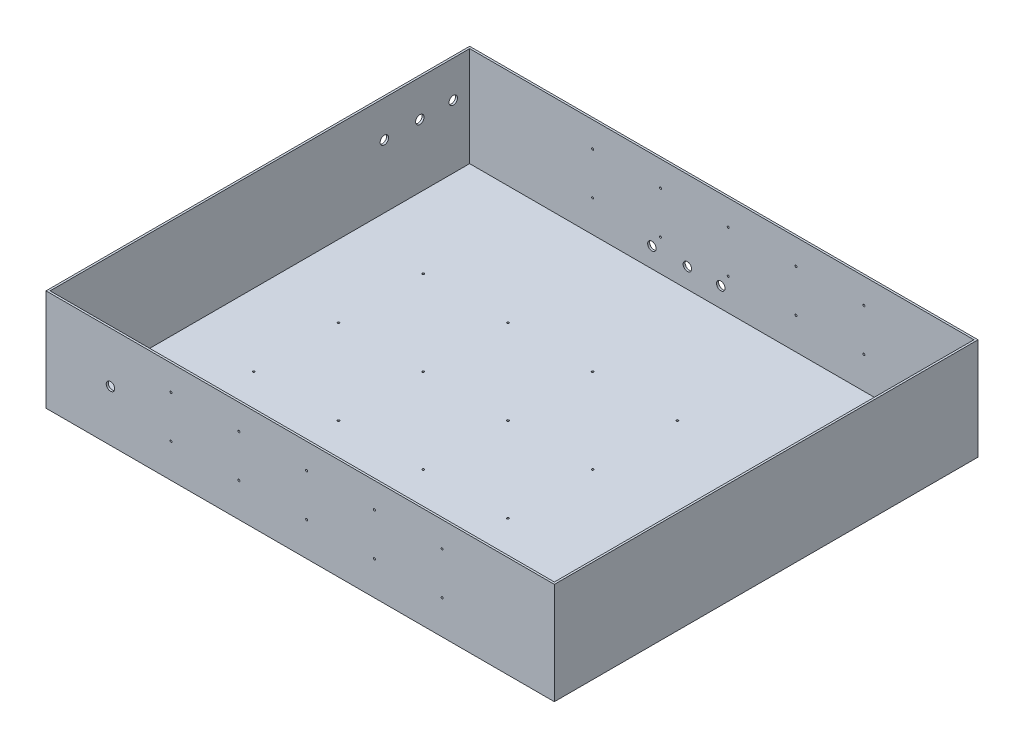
from build123d import *

# Parameters (mm, degrees)
SKETCH1_W                              = 762
SKETCH1_H                              = 635
EXTRUDE1_DEPTH                         = 152.4
SHELL1_T                               = -3.048
SKETCH2_R                              = 6.35
CONNECTOR_MOUNT_CUT_EXTRUDE1_DEPTH     = 824.143737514
SKETCH3_R                              = 1.524
CLIP_MOUNT_CUT_EXTRUDE2_DEPTH          = 828.354071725
LPATTERN2_COUNT                        = 5
LPATTERN2_PITCH                        = 101.6
LPATTERN2_COUNT_DIR2                   = 2
LPATTERN2_PITCH_DIR2                   = 63.5
SKETCH4_R                              = 6.35
LOWER_CONNECTOR_MNT_CUT_EXTRUDE1_DEPTH = 3.048
SKETCH5_R                              = 1.524
CUT_EXTRUDE1_DEPTH                     = 3.048
LPATTERN4_COUNT                        = 3
LPATTERN4_PITCH                        = 127
LPATTERN4_COUNT_DIR2                   = 5
LPATTERN4_PITCH_DIR2                   = 127
SKETCH6_R                              = 6.35
CUT_EXTRUDE2_DEPTH                     = 928.579622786


with BuildPart() as part:
    # Sketch1 → Extrude1 (new body)
    with BuildSketch(Plane(origin=(0, 0, 0), x_dir=(1, 0, 0), z_dir=(0, 1, 0))):
        with Locations((-127, 190.5)):
            Rectangle(SKETCH1_W, SKETCH1_H)
    extrude(amount=EXTRUDE1_DEPTH)

    # Shell1
    shell1_openings = [part.faces().sort_by_distance(p)[0] for p in [
        (-127, 152.4, -190.5),
    ]]
    offset(amount=SHELL1_T, openings=shell1_openings, kind=Kind.INTERSECTION)

    # Sketch2 → Connector mount--Cut-Extrude1 (cut, through all)
    with BuildSketch(Plane(origin=(-3.048, 0, -504.952), x_dir=(1, 0, 0), z_dir=(0, 0, 1))):
        with Locations((-228.718392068, 32.6517)):
            Circle(SKETCH2_R)
        with Locations((-175.538392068, 32.6517)):
            Circle(SKETCH2_R)
        with Locations((-125.411535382, 32.6517)):
            Circle(SKETCH2_R)
    extrude(amount=-CONNECTOR_MOUNT_CUT_EXTRUDE1_DEPTH, mode=Mode.SUBTRACT)

    # Sketch3 → Clip Mount --Cut-Extrude2 (cut, through all)
    with BuildSketch(Plane(origin=(0, 0, -508), x_dir=(-1, 0, 0), z_dir=(0, 0, -1))):
        with Locations((-85.852, 114.3)):
            Circle(SKETCH3_R)
    clip_mount_cut_extrude2 = extrude(amount=-CLIP_MOUNT_CUT_EXTRUDE2_DEPTH, mode=Mode.SUBTRACT)

    # LPattern2: Clip Mount --Cut-Extrude2 5 × 2
    with Locations(*[(-i * LPATTERN2_PITCH, -j * LPATTERN2_PITCH_DIR2, 0) for i in range(LPATTERN2_COUNT) for j in range(LPATTERN2_COUNT_DIR2) if (i, j) != (0, 0)]):
        add(clip_mount_cut_extrude2, mode=Mode.SUBTRACT)

    # Sketch4 → Lower Connector Mnt--Cut-Extrude1 (cut)
    with BuildSketch(Plane.XY.offset(127)):
        with Locations((-411.374764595, 76.774011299)):
            Circle(SKETCH4_R)
    extrude(amount=-LOWER_CONNECTOR_MNT_CUT_EXTRUDE1_DEPTH, mode=Mode.SUBTRACT)

    # Sketch5 → Cut-Extrude1 (cut)
    with BuildSketch(Plane(origin=(0, 3.048, 0), x_dir=(-1, 0, 0), z_dir=(0, 1, 0))):
        with Locations(Location((-111.252, -327.152, 0), (0, 0, 90))):
            Circle(SKETCH5_R)
    cut_extrude1 = extrude(amount=-CUT_EXTRUDE1_DEPTH, mode=Mode.SUBTRACT)

    # LPattern4: Cut-Extrude1 3 × 5
    with Locations(*[(-j * LPATTERN4_PITCH_DIR2, 0, i * LPATTERN4_PITCH) for i in range(LPATTERN4_COUNT) for j in range(LPATTERN4_COUNT_DIR2) if (i, j) != (0, 0)]):
        add(cut_extrude1, mode=Mode.SUBTRACT)

    # Sketch6 → Cut-Extrude2 (cut, through all)
    with BuildSketch(Plane(origin=(-504.952, 0, 3.048), x_dir=(0, 0, -1), z_dir=(1, 0, 0))):
        with Locations((380.181846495, 97.593006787)):
            Circle(SKETCH6_R)
        with Locations((433.361846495, 97.593006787)):
            Circle(SKETCH6_R)
        with Locations((483.488703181, 97.593006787)):
            Circle(SKETCH6_R)
    extrude(amount=-CUT_EXTRUDE2_DEPTH, mode=Mode.SUBTRACT)


solid = part.part
